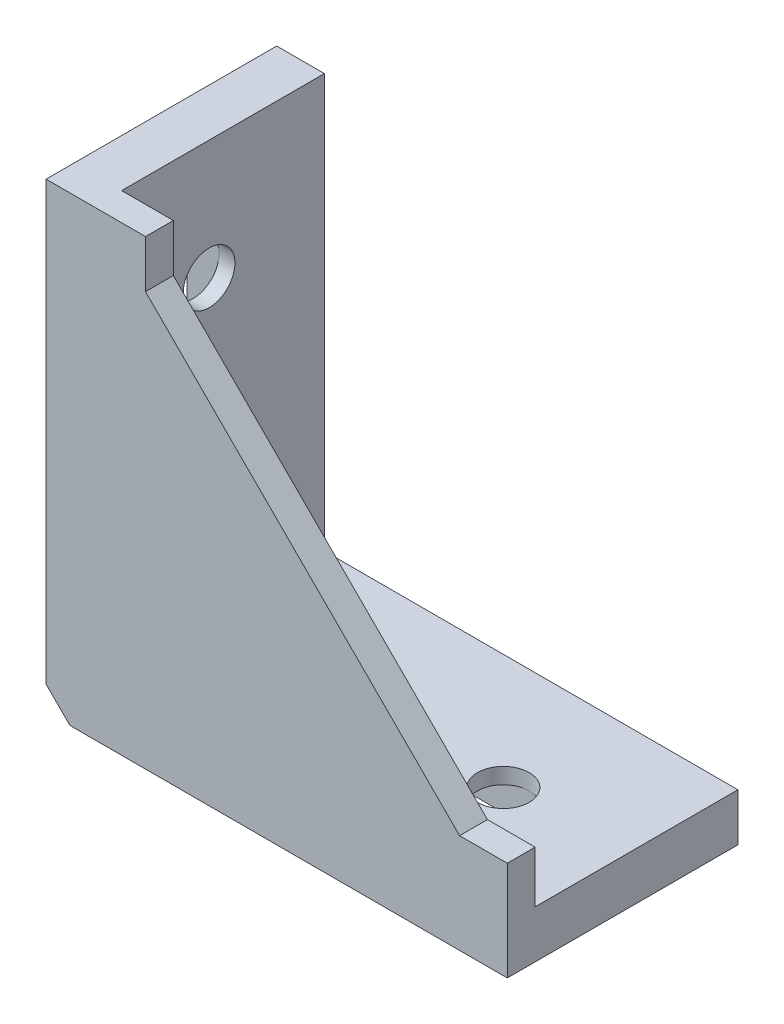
from build123d import *

# Parameters (mm, degrees)
EXTRUDE_1_DEPTH     = 29
EXTRUDE_2_DEPTH     = 3.5
CUT_EXTRUDE_1_DEPTH = 87.656686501
SKETCH_4_W          = 4
SKETCH_4_H          = 47.176431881
SKETCH_4_H_2        = 47.779487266
CUT_EXTRUDE_2_DEPTH = 4
SKETCH_5_W          = 5
SKETCH_5_H          = 2
EXTRUDE_3_DEPTH     = 2
CHAMFER_1_SIZE      = 3


with BuildPart() as part:
    # Sketch 1 → Extrude 1 (new body)
    with BuildSketch(Plane.XY):
        Polygon((-42.388424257, 57.483748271), (-36.388424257, 57.483748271), (-36.388424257, 5.483748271), (15.611575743, 5.483748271), (15.611575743, -0.516251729), (-42.388424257, -0.516251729), align=None)
    extrude(amount=EXTRUDE_1_DEPTH)

    # Sketch 2 → Extrude 2 (add)
    with BuildSketch(Plane.XY.offset(29)):
        Polygon((-36.388424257, 57.483748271), (-29.888424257, 57.483748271), (-29.888424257, 51.483748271), (9.611575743, 11.983748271), (15.611575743, 11.983748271), (15.611575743, 5.483748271), (-36.388424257, 5.483748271), align=None)
    extrude(amount=-EXTRUDE_2_DEPTH)

    # Sketch 3 → Cut-Extrude 1 (cut, through all)
    with BuildSketch(Plane.ZY.offset(42.388424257)):
        with BuildLine():
            ThreePointArc((17.75, 26.483748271), (16.798097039, 28.78184531), (14.5, 29.733748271))
            Line((14.5, 29.733748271), (14.5, 11.233748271))
            ThreePointArc((14.5, 11.233748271), (16.798097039, 12.185651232), (17.75, 14.483748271))
            Line((17.75, 14.483748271), (17.75, 26.483748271))
        make_face()
        with BuildLine():
            ThreePointArc((17.75, 42.483748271), (16.798097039, 44.78184531), (14.5, 45.733748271))
            Line((14.5, 45.733748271), (14.5, 39.233748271))
            ThreePointArc((14.5, 39.233748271), (16.798097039, 40.185651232), (17.75, 42.483748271))
        make_face()
        with BuildLine():
            Line((14.5, 39.233748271), (14.5, 45.733748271))
            ThreePointArc((14.5, 45.733748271), (11.25, 42.483748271), (14.5, 39.233748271))
        make_face()
        with BuildLine():
            ThreePointArc((17.75, 42.483748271), (16.798097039, 44.78184531), (14.5, 45.733748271))
            Line((14.5, 45.733748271), (14.5, 39.233748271))
            ThreePointArc((14.5, 39.233748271), (16.798097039, 40.185651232), (17.75, 42.483748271))
        make_face()
        with BuildLine():
            Line((14.5, 39.233748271), (14.5, 45.733748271))
            ThreePointArc((14.5, 45.733748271), (11.25, 42.483748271), (14.5, 39.233748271))
        make_face()
        with BuildLine():
            Line((14.5, 11.233748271), (14.5, 29.733748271))
            ThreePointArc((14.5, 29.733748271), (12.201902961, 28.78184531), (11.25, 26.483748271))
            Line((11.25, 26.483748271), (11.25, 14.483748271))
            ThreePointArc((11.25, 14.483748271), (12.201902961, 12.185651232), (14.5, 11.233748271))
        make_face()
    cut_extrude_1 = extrude(amount=-CUT_EXTRUDE_1_DEPTH, mode=Mode.SUBTRACT)

    # Sketch 4 → Cut-Extrude 2 (cut)
    with BuildSketch(Plane.ZY.offset(42.388424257)):
        with Locations((5.5, 30.071964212)):
            Rectangle(SKETCH_4_W, SKETCH_4_H)
        with BuildLine():
            ThreePointArc((17.75, 42.483748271), (14.5, 39.233748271), (11.25, 42.483748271))
            Line((11.25, 42.483748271), (11.25, 26.483748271))
            ThreePointArc((11.25, 26.483748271), (14.5, 29.733748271), (17.75, 26.483748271))
            Line((17.75, 26.483748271), (17.75, 42.483748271))
        make_face()
        with BuildLine():
            Line((11.25, 50.483748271), (11.25, 42.483748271))
            ThreePointArc((11.25, 42.483748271), (14.5, 45.733748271), (17.75, 42.483748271))
            Line((17.75, 42.483748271), (17.75, 50.483748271))
            Line((17.75, 50.483748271), (11.25, 50.483748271))
        make_face()
        with Locations((23.5, 29.770436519)):
            Rectangle(SKETCH_4_W, SKETCH_4_H_2)
        with BuildLine():
            ThreePointArc((17.75, 14.483748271), (14.5, 11.233748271), (11.25, 14.483748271))
            Line((11.25, 14.483748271), (11.25, 6.483748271))
            Line((11.25, 6.483748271), (17.75, 6.483748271))
            Line((17.75, 6.483748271), (17.75, 14.483748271))
        make_face()
    cut_extrude_2 = extrude(amount=-CUT_EXTRUDE_2_DEPTH, mode=Mode.SUBTRACT)

    # Mirror 1: Cut-Extrude 1, Cut-Extrude 2 across plane
    add(cut_extrude_1.mirror(Plane(origin=(-20.936086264, 20.936086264, 0), x_dir=(0, 0, 1), z_dir=(0.7071067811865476, -0.7071067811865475, 0))), mode=Mode.SUBTRACT)
    add(cut_extrude_2.mirror(Plane(origin=(-20.936086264, 20.936086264, 0), x_dir=(0, 0, 1), z_dir=(0.7071067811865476, -0.7071067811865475, 0))), mode=Mode.SUBTRACT)

    # Sketch 5 → Extrude 3 (add)
    with BuildSketch(Plane.ZY.offset(42.388424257)):
        with Locations((14.5, 5.483748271)):
            Rectangle(SKETCH_5_W, SKETCH_5_H)
        with Locations((14.5, 51.483748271)):
            Rectangle(SKETCH_5_W, SKETCH_5_H)
    extrude_3 = extrude(amount=EXTRUDE_3_DEPTH)

    # Mirror 2: Extrude 3 across plane
    add(extrude_3.mirror(Plane(origin=(-20.936086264, 20.936086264, 0), x_dir=(0, 0, 1), z_dir=(0.7071067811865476, -0.7071067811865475, 0))))

    # Chamfer 1
    chamfer_1_edges = [part.edges().sort_by_distance(p)[0] for p in [
        (-42.388424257, -0.516251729, 14.5),
    ]]
    chamfer(chamfer_1_edges, length=CHAMFER_1_SIZE)


solid = part.part
